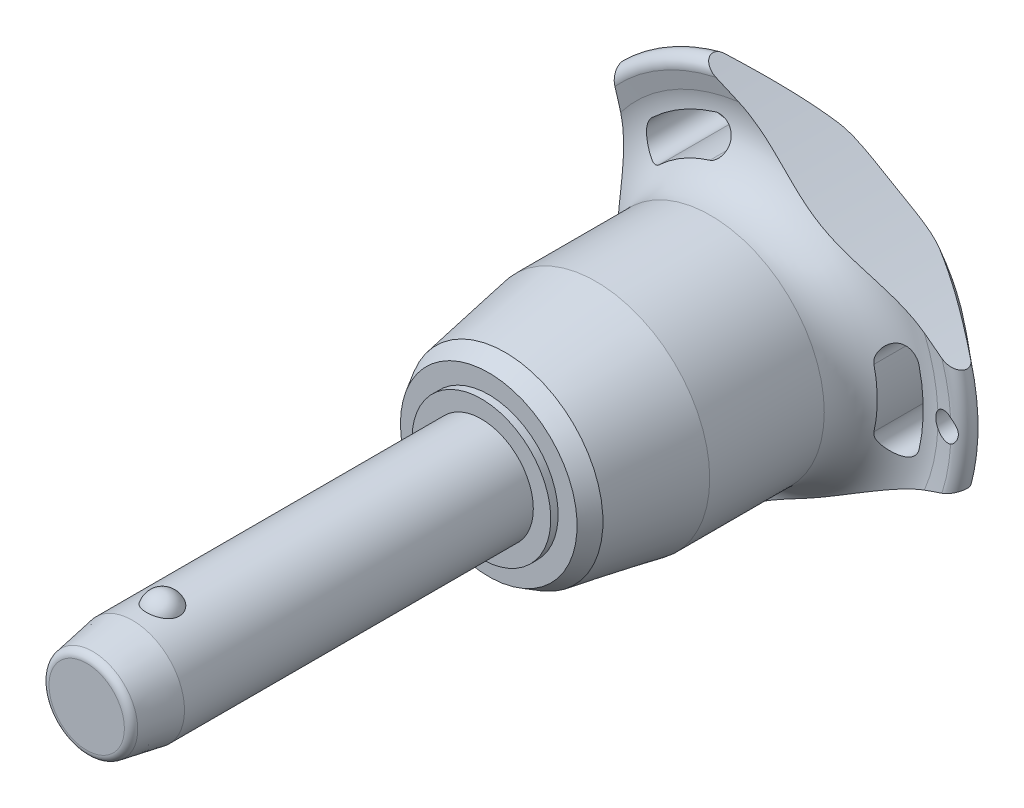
from build123d import *

# Parameters (mm, degrees)
SKETCH1_R           = 6
BOSS_EXTRUDE1_DEPTH = 35
SKETCH2_R           = 5.15
BOSS_EXTRUDE2_DEPTH = 39.7
BOSS_EXTRUDE3_START = 10.6
SKETCH1_2_R         = 6
BOSS_EXTRUDE3_DEPTH = 10.6
CHAMFER1_SIZE       = 5.3
CHAMFER1_SIZE2      = 0.934532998
FILLET1_R           = 0.85
SKETCH6_R           = 144.275
CUT_EXTRUDE1_DEPTH  = 82.935434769
CIRPATTERN1_COUNT   = 3
SKETCH7_R           = 1.5
CUT_EXTRUDE2_DEPTH  = 82.690131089


with BuildPart() as part:
    # Sketch1 → Boss-Extrude1 (new body)
    with BuildSketch(Plane.XY):
        Circle(SKETCH1_R)
    extrude(amount=-BOSS_EXTRUDE1_DEPTH)

    # Sketch2 → Boss-Extrude2 (add)
    with BuildSketch(Plane(origin=(0, 0, -35), x_dir=(-1, 0, 0), z_dir=(0, 0, -1))):
        Circle(SKETCH2_R)
    extrude(amount=BOSS_EXTRUDE2_DEPTH)

    # Sketch3 → Revolve1 (revolve)
    with BuildSketch(Plane(origin=(0, 0, 0), x_dir=(0, 0, -1), z_dir=(1, 0, 0))):
        with BuildLine():
            Line((-1.854049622, 7.25), (-1.854049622, 3.25))
            ThreePointArc((-1.854049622, 3.25), (0.145950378, 5.25), (-1.854049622, 7.25))
        make_face()
        with BuildLine():
            Line((-1.854049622, -3.25), (-1.854049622, -7.25))
            ThreePointArc((-1.854049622, -7.25), (0.145950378, -5.25), (-1.854049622, -3.25))
        make_face()
    revolve(axis=Axis((0, -3.25, 1.854049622), (0, 1, 0)))

    # Sketch1_2 → Boss-Extrude3 (add)
    with BuildSketch(Plane.XY.offset(BOSS_EXTRUDE3_START)):
        Circle(SKETCH1_2_R)
    extrude(amount=-BOSS_EXTRUDE3_DEPTH)

    # Chamfer1
    chamfer1_edges = [part.edges().sort_by_distance(p)[0] for p in [
        (-6, 0, 10.6),
    ]]
    chamfer1_side = [part.faces().sort_by_distance(p)[0] for p in [
        (-6, 0, -12.2),
    ]]
    chamfer(chamfer1_edges, length=CHAMFER1_SIZE, length2=CHAMFER1_SIZE2, reference=chamfer1_side[0])

    # Fillet1
    fillet1_edges = [part.edges().sort_by_distance(p)[0] for p in [
        (-5.065467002, 0, 10.6),
        (5.15, 0, -74.7),
    ]]
    fillet(fillet1_edges, radius=FILLET1_R)

    # Sketch4 → Revolve2 (revolve)
    with BuildSketch(Plane(origin=(0, 0, 0), x_dir=(0, 0, -1), z_dir=(1, 0, 0)), mode=Mode.PRIVATE) as revolve2_sk:
        Polygon((35, 0), (35, 8.017240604), (35.85, 8.017240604), (35.85, 10.206249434), (37.745737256, 11.300753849), (48.233333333, 13.15), (61.466666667, 13.15), (61.466666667, 0), align=None)
    revolve(revolve2_sk.sketch.rotate(Axis((0, 0, -61.466666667), (0, 0, 1)), 90), axis=Axis((0, 0, -61.466666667), (0, 0, 1)))

    # Sketch5 → Revolve3 (revolve)
    with BuildSketch(Plane(origin=(0, 0, 0), x_dir=(0, 0, -1), z_dir=(1, 0, 0)), mode=Mode.PRIVATE) as revolve3_sk:
        with BuildLine():
            Line((67.32877039, 20.428960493), (66.910912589, 22.344207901))
            ThreePointArc((66.910912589, 22.344207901), (67.554394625, 23.677136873), (69.002586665, 23.371345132))
            Line((69.002586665, 23.371345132), (74.141488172, 17.247040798))
            ThreePointArc((74.141488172, 17.247040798), (74.7, 15.584758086), (73.978803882, 13.986322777))
            ThreePointArc((73.978803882, 13.986322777), (69.617427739, 7.589034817), (68.083333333, 0))
            Line((68.083333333, 0), (61.466666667, 0))
            Line((61.466666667, 0), (61.466666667, 13.15))
            ThreePointArc((61.466666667, 13.15), (66.139661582, 15.38660811), (67.32877039, 20.428960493))
        make_face()
    revolve(revolve3_sk.sketch.rotate(Axis((0, 0, -68.083333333), (0, 0, 1)), 90), axis=Axis((0, 0, -68.083333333), (0, 0, 1)))

    # Sketch6 → Cut-Extrude1 (cut, through all)
    with BuildSketch(Plane.XY):
        with Locations((-159.975, 0)):
            Circle(SKETCH6_R)
        with BuildLine():
            ThreePointArc((18.131206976, -4.190753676), (18.60922037, 0), (18.131206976, 4.190753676))
            ThreePointArc((18.131206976, 4.190753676), (15.94840906, 5.553949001), (14.585213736, 3.371151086))
            ThreePointArc((14.585213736, 3.371151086), (14.969740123, 0), (14.585213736, -3.371151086))
            ThreePointArc((14.585213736, -3.371151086), (15.94840906, -5.553949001), (18.131206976, -4.190753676))
        make_face()
    cut_extrude1 = extrude(amount=-CUT_EXTRUDE1_DEPTH, mode=Mode.SUBTRACT)

    # CirPattern1: Cut-Extrude1 ×3 about axis
    cirpattern1_axis = Axis((0, 0, 0), (0, 0, 1))
    for i in range(1, CIRPATTERN1_COUNT):
        add(cut_extrude1.rotate(cirpattern1_axis, i * 360 / CIRPATTERN1_COUNT), mode=Mode.SUBTRACT)

    # Sketch7 → Cut-Extrude2 (cut, through all)
    with BuildSketch(Plane.XY):
        with Locations(Location((21.60922037, 0, 0), (0, 0, 297.620773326))):
            Circle(SKETCH7_R)
    extrude(amount=-CUT_EXTRUDE2_DEPTH, mode=Mode.SUBTRACT)


solid = part.part
